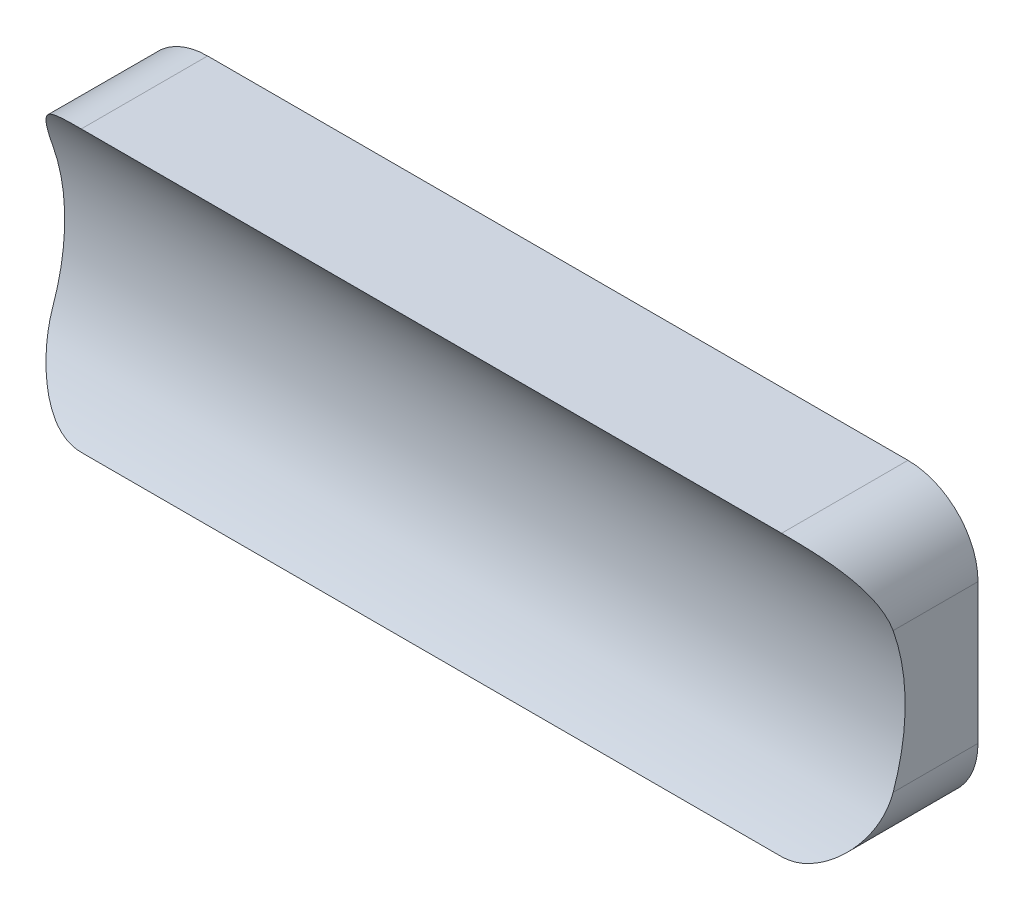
ISO-10303-21;
HEADER;
FILE_DESCRIPTION(('STEP AP214'),'2;1');
FILE_NAME('part.step','',(''),(''),'','','');
FILE_SCHEMA(('AUTOMOTIVE_DESIGN { 1 0 10303 214 1 1 1 1 }'));
ENDSEC;
DATA;
#1=APPLICATION_CONTEXT('core data for automotive mechanical design processes');
#2=APPLICATION_PROTOCOL_DEFINITION('international standard','automotive_design',2000,#1);
#3=PRODUCT_CONTEXT('',#1,'mechanical');
#4=PRODUCT('Part','Part','',(#3));
#5=PRODUCT_RELATED_PRODUCT_CATEGORY('part','',(#4));
#6=PRODUCT_DEFINITION_FORMATION('','',#4);
#7=PRODUCT_DEFINITION_CONTEXT('part definition',#1,'design');
#8=PRODUCT_DEFINITION('design','',#6,#7);
#9=PRODUCT_DEFINITION_SHAPE('','',#8);
#10=(LENGTH_UNIT() NAMED_UNIT(*) SI_UNIT(.MILLI.,.METRE.));
#11=(NAMED_UNIT(*) PLANE_ANGLE_UNIT() SI_UNIT($,.RADIAN.));
#12=(NAMED_UNIT(*) SI_UNIT($,.STERADIAN.) SOLID_ANGLE_UNIT());
#13=UNCERTAINTY_MEASURE_WITH_UNIT(LENGTH_MEASURE(1.E-05),#10,'distance_accuracy_value','');
#14=(GEOMETRIC_REPRESENTATION_CONTEXT(3) GLOBAL_UNCERTAINTY_ASSIGNED_CONTEXT((#13)) GLOBAL_UNIT_ASSIGNED_CONTEXT((#10,
#11,#12)) REPRESENTATION_CONTEXT('',''));
#15=CARTESIAN_POINT('',(0.,0.,0.));
#16=DIRECTION('',(0.,0.,1.));
#17=DIRECTION('',(1.,0.,0.));
#18=AXIS2_PLACEMENT_3D('',#15,#16,#17);
#19=CARTESIAN_POINT('',(19.05,-6.35,8.255));
#20=DIRECTION('',(0.,1.,0.));
#21=DIRECTION('',(0.,0.,1.));
#22=AXIS2_PLACEMENT_3D('',#19,#20,#21);
#23=PLANE('',#22);
#24=DIRECTION('',(-1.,0.,0.));
#25=VECTOR('',#24,1.);
#26=CARTESIAN_POINT('',(45.9907683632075,-6.35,5.72748417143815));
#27=LINE('',#26,#25);
#28=CARTESIAN_POINT('',(15.875,-6.35,5.72748417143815));
#29=VERTEX_POINT('',#28);
#30=CARTESIAN_POINT('',(-15.875,-6.35,5.72748417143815));
#31=VERTEX_POINT('',#30);
#32=EDGE_CURVE('E106',#29,#31,#27,.T.);
#33=ORIENTED_EDGE('',*,*,#32,.T.);
#34=DIRECTION('',(0.,0.,-1.));
#35=VECTOR('',#34,1.);
#36=CARTESIAN_POINT('',(-15.875,-6.35,8.255));
#37=LINE('',#36,#35);
#38=CARTESIAN_POINT('',(-15.875,-6.35,0.));
#39=VERTEX_POINT('',#38);
#40=EDGE_CURVE('E112',#31,#39,#37,.T.);
#41=ORIENTED_EDGE('',*,*,#40,.T.);
#42=DIRECTION('',(-1.,0.,0.));
#43=VECTOR('',#42,1.);
#44=CARTESIAN_POINT('',(19.05,-6.35,0.));
#45=LINE('',#44,#43);
#46=CARTESIAN_POINT('',(15.875,-6.35,0.));
#47=VERTEX_POINT('',#46);
#48=EDGE_CURVE('E109',#47,#39,#45,.T.);
#49=ORIENTED_EDGE('',*,*,#48,.F.);
#50=DIRECTION('',(0.,0.,-1.));
#51=VECTOR('',#50,1.);
#52=CARTESIAN_POINT('',(15.875,-6.35,5.72748417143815));
#53=LINE('',#52,#51);
#54=EDGE_CURVE('E103',#47,#29,#53,.F.);
#55=ORIENTED_EDGE('',*,*,#54,.T.);
#56=EDGE_LOOP('',(#33,#41,#49,#55));
#57=FACE_BOUND('',#56,.T.);
#58=ADVANCED_FACE('F34',(#57),#23,.F.);
#59=CARTESIAN_POINT('',(19.05,6.35,0.));
#60=DIRECTION('',(0.,0.,1.));
#61=DIRECTION('',(0.,-1.,0.));
#62=AXIS2_PLACEMENT_3D('',#59,#60,#61);
#63=PLANE('',#62);
#64=ORIENTED_EDGE('',*,*,#48,.T.);
#65=CARTESIAN_POINT('',(-15.875,-3.175,0.));
#66=DIRECTION('',(0.,0.,1.));
#67=DIRECTION('',(0.,-1.,0.));
#68=AXIS2_PLACEMENT_3D('',#65,#66,#67);
#69=CIRCLE('',#68,3.175);
#70=CARTESIAN_POINT('',(-19.05,-3.175,0.));
#71=VERTEX_POINT('',#70);
#72=EDGE_CURVE('E197',#39,#71,#69,.F.);
#73=ORIENTED_EDGE('',*,*,#72,.T.);
#74=DIRECTION('',(0.,1.,0.));
#75=VECTOR('',#74,1.);
#76=CARTESIAN_POINT('',(-19.05,6.35,0.));
#77=LINE('',#76,#75);
#78=CARTESIAN_POINT('',(-19.05,3.175,0.));
#79=VERTEX_POINT('',#78);
#80=EDGE_CURVE('E120',#71,#79,#77,.T.);
#81=ORIENTED_EDGE('',*,*,#80,.T.);
#82=CARTESIAN_POINT('',(-15.875,3.175,0.));
#83=DIRECTION('',(0.,0.,1.));
#84=DIRECTION('',(0.,-1.,0.));
#85=AXIS2_PLACEMENT_3D('',#82,#83,#84);
#86=CIRCLE('',#85,3.175);
#87=CARTESIAN_POINT('',(-15.875,6.35,0.));
#88=VERTEX_POINT('',#87);
#89=EDGE_CURVE('E201',#79,#88,#86,.F.);
#90=ORIENTED_EDGE('',*,*,#89,.T.);
#91=DIRECTION('',(-1.,0.,0.));
#92=VECTOR('',#91,1.);
#93=CARTESIAN_POINT('',(19.05,6.35,0.));
#94=LINE('',#93,#92);
#95=CARTESIAN_POINT('',(15.875,6.35,0.));
#96=VERTEX_POINT('',#95);
#97=EDGE_CURVE('E209',#96,#88,#94,.T.);
#98=ORIENTED_EDGE('',*,*,#97,.F.);
#99=CARTESIAN_POINT('',(15.875,3.175,0.));
#100=DIRECTION('',(0.,0.,1.));
#101=DIRECTION('',(0.,-1.,0.));
#102=AXIS2_PLACEMENT_3D('',#99,#100,#101);
#103=CIRCLE('',#102,3.175);
#104=CARTESIAN_POINT('',(19.05,3.175,0.));
#105=VERTEX_POINT('',#104);
#106=EDGE_CURVE('E205',#96,#105,#103,.F.);
#107=ORIENTED_EDGE('',*,*,#106,.T.);
#108=DIRECTION('',(0.,1.,0.));
#109=VECTOR('',#108,1.);
#110=CARTESIAN_POINT('',(19.05,6.35,0.));
#111=LINE('',#110,#109);
#112=CARTESIAN_POINT('',(19.05,-3.175,0.));
#113=VERTEX_POINT('',#112);
#114=EDGE_CURVE('E195',#113,#105,#111,.T.);
#115=ORIENTED_EDGE('',*,*,#114,.F.);
#116=CARTESIAN_POINT('',(15.875,-3.175,0.));
#117=DIRECTION('',(0.,0.,1.));
#118=DIRECTION('',(0.,-1.,0.));
#119=AXIS2_PLACEMENT_3D('',#116,#117,#118);
#120=CIRCLE('',#119,3.175);
#121=EDGE_CURVE('E203',#113,#47,#120,.F.);
#122=ORIENTED_EDGE('',*,*,#121,.T.);
#123=EDGE_LOOP('',(#64,#73,#81,#90,#98,#107,#115,#122));
#124=FACE_BOUND('',#123,.T.);
#125=ADVANCED_FACE('F173',(#124),#63,.F.);
#126=CARTESIAN_POINT('',(19.05,6.35,8.255));
#127=DIRECTION('',(0.,-1.,0.));
#128=DIRECTION('',(0.,0.,-1.));
#129=AXIS2_PLACEMENT_3D('',#126,#127,#128);
#130=PLANE('',#129);
#131=ORIENTED_EDGE('',*,*,#97,.T.);
#132=DIRECTION('',(0.,0.,1.));
#133=VECTOR('',#132,1.);
#134=CARTESIAN_POINT('',(-15.875,6.35,8.255));
#135=LINE('',#134,#133);
#136=CARTESIAN_POINT('',(-15.875,6.35,5.72748417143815));
#137=VERTEX_POINT('',#136);
#138=EDGE_CURVE('E218',#88,#137,#135,.T.);
#139=ORIENTED_EDGE('',*,*,#138,.T.);
#140=DIRECTION('',(-1.,0.,0.));
#141=VECTOR('',#140,1.);
#142=CARTESIAN_POINT('',(45.9907683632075,6.35,5.72748417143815));
#143=LINE('',#142,#141);
#144=CARTESIAN_POINT('',(15.875,6.35,5.72748417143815));
#145=VERTEX_POINT('',#144);
#146=EDGE_CURVE('E121',#137,#145,#143,.F.);
#147=ORIENTED_EDGE('',*,*,#146,.T.);
#148=DIRECTION('',(0.,0.,1.));
#149=VECTOR('',#148,1.);
#150=CARTESIAN_POINT('',(15.875,6.35,0.));
#151=LINE('',#150,#149);
#152=EDGE_CURVE('E158',#145,#96,#151,.F.);
#153=ORIENTED_EDGE('',*,*,#152,.T.);
#154=EDGE_LOOP('',(#131,#139,#147,#153));
#155=FACE_BOUND('',#154,.T.);
#156=ADVANCED_FACE('F177',(#155),#130,.F.);
#157=CARTESIAN_POINT('',(19.05,-6.35,8.255));
#158=DIRECTION('',(1.,0.,0.));
#159=DIRECTION('',(0.,0.,-1.));
#160=AXIS2_PLACEMENT_3D('',#157,#158,#159);
#161=PLANE('',#160);
#162=CARTESIAN_POINT('',(19.05,0.,12.827));
#163=DIRECTION('',(1.,0.,0.));
#164=DIRECTION('',(0.,0.,-1.));
#165=AXIS2_PLACEMENT_3D('',#162,#163,#164);
#166=CIRCLE('',#165,9.52500000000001);
#167=CARTESIAN_POINT('',(19.05,3.175,3.84674387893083));
#168=VERTEX_POINT('',#167);
#169=CARTESIAN_POINT('',(19.05,-3.175,3.84674387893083));
#170=VERTEX_POINT('',#169);
#171=EDGE_CURVE('E215',#168,#170,#166,.F.);
#172=ORIENTED_EDGE('',*,*,#171,.T.);
#173=DIRECTION('',(0.,0.,-1.));
#174=VECTOR('',#173,1.);
#175=CARTESIAN_POINT('',(19.05,-3.175,0.));
#176=LINE('',#175,#174);
#177=EDGE_CURVE('E11',#170,#113,#176,.T.);
#178=ORIENTED_EDGE('',*,*,#177,.T.);
#179=ORIENTED_EDGE('',*,*,#114,.T.);
#180=DIRECTION('',(0.,0.,1.));
#181=VECTOR('',#180,1.);
#182=CARTESIAN_POINT('',(19.05,3.175,5.72748417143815));
#183=LINE('',#182,#181);
#184=EDGE_CURVE('E43',#105,#168,#183,.T.);
#185=ORIENTED_EDGE('',*,*,#184,.T.);
#186=EDGE_LOOP('',(#172,#178,#179,#185));
#187=FACE_BOUND('',#186,.T.);
#188=ADVANCED_FACE('F148',(#187),#161,.T.);
#189=CARTESIAN_POINT('',(-19.05,-6.35,8.255));
#190=DIRECTION('',(1.,0.,0.));
#191=DIRECTION('',(0.,0.,-1.));
#192=AXIS2_PLACEMENT_3D('',#189,#190,#191);
#193=PLANE('',#192);
#194=ORIENTED_EDGE('',*,*,#80,.F.);
#195=DIRECTION('',(0.,0.,-1.));
#196=VECTOR('',#195,1.);
#197=CARTESIAN_POINT('',(-19.05,-3.175,8.255));
#198=LINE('',#197,#196);
#199=CARTESIAN_POINT('',(-19.05,-3.175,3.84674387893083));
#200=VERTEX_POINT('',#199);
#201=EDGE_CURVE('E127',#71,#200,#198,.F.);
#202=ORIENTED_EDGE('',*,*,#201,.T.);
#203=CARTESIAN_POINT('',(-19.05,0.,12.827));
#204=DIRECTION('',(-1.,0.,0.));
#205=DIRECTION('',(0.,0.,1.));
#206=AXIS2_PLACEMENT_3D('',#203,#204,#205);
#207=CIRCLE('',#206,9.52500000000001);
#208=CARTESIAN_POINT('',(-19.05,3.175,3.84674387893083));
#209=VERTEX_POINT('',#208);
#210=EDGE_CURVE('E217',#209,#200,#207,.T.);
#211=ORIENTED_EDGE('',*,*,#210,.F.);
#212=DIRECTION('',(0.,0.,1.));
#213=VECTOR('',#212,1.);
#214=CARTESIAN_POINT('',(-19.05,3.175,8.255));
#215=LINE('',#214,#213);
#216=EDGE_CURVE('E194',#209,#79,#215,.F.);
#217=ORIENTED_EDGE('',*,*,#216,.T.);
#218=EDGE_LOOP('',(#194,#202,#211,#217));
#219=FACE_BOUND('',#218,.T.);
#220=ADVANCED_FACE('F147',(#219),#193,.F.);
#221=CARTESIAN_POINT('',(45.9907683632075,0.,12.827));
#222=DIRECTION('',(-1.,0.,0.));
#223=DIRECTION('',(0.,0.,1.));
#224=AXIS2_PLACEMENT_3D('',#221,#222,#223);
#225=CYLINDRICAL_SURFACE('',#224,9.52500000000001);
#226=ORIENTED_EDGE('',*,*,#210,.T.);
#227=CARTESIAN_POINT('',(-19.05,-3.175,3.84674387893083));
#228=CARTESIAN_POINT('',(-19.0500070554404,-3.27165376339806,3.88089987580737));
#229=CARTESIAN_POINT('',(-19.0455873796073,-3.3677140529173,3.91663340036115));
#230=CARTESIAN_POINT('',(-19.028268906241,-3.55790883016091,3.99086700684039));
#231=CARTESIAN_POINT('',(-19.0153761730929,-3.65204464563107,4.02936509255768));
#232=CARTESIAN_POINT('',(-18.9815654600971,-3.83735010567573,4.10860035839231));
#233=CARTESIAN_POINT('',(-18.9606859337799,-3.92853172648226,4.14932602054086));
#234=CARTESIAN_POINT('',(-18.9112905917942,-4.10785595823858,4.23276114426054));
#235=CARTESIAN_POINT('',(-18.8827734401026,-4.19599803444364,4.27547095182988));
#236=CARTESIAN_POINT('',(-18.7865009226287,-4.45466663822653,4.40567986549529));
#237=CARTESIAN_POINT('',(-18.7078988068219,-4.62010190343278,4.49554656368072));
#238=CARTESIAN_POINT('',(-18.5241971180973,-4.93444559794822,4.67776404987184));
#239=CARTESIAN_POINT('',(-18.4190373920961,-5.08331538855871,4.77012004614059));
#240=CARTESIAN_POINT('',(-18.1738048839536,-5.37395079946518,4.96068039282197));
#241=CARTESIAN_POINT('',(-18.0314854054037,-5.51396116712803,5.05869128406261));
#242=CARTESIAN_POINT('',(-17.7192488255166,-5.76722793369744,5.2448275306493));
#243=CARTESIAN_POINT('',(-17.5493776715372,-5.8805281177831,5.33296893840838));
#244=CARTESIAN_POINT('',(-17.2392583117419,-6.04558974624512,5.46601260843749));
#245=CARTESIAN_POINT('',(-17.1055479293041,-6.10560330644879,5.51593547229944));
#246=CARTESIAN_POINT('',(-16.827481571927,-6.20735593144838,5.60212511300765));
#247=CARTESIAN_POINT('',(-16.6831612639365,-6.24915322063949,5.63843534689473));
#248=CARTESIAN_POINT('',(-16.4280310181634,-6.30337970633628,5.68599551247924));
#249=CARTESIAN_POINT('',(-16.3190406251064,-6.32074057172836,5.70140410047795));
#250=CARTESIAN_POINT('',(-16.1537191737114,-6.33823215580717,5.71697227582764));
#251=CARTESIAN_POINT('',(-16.0981609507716,-6.3426379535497,5.72090452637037));
#252=CARTESIAN_POINT('',(-15.986740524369,-6.34852447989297,5.72616420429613));
#253=CARTESIAN_POINT('',(-15.9308781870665,-6.35000379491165,5.72749037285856));
#254=CARTESIAN_POINT('',(-15.875,-6.35,5.72748417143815));
#255=B_SPLINE_CURVE_WITH_KNOTS('',3,(#227,#228,#229,#230,#231,#232,#233,#234,#235,#236,#237,
#238,#239,#240,#241,#242,#243,#244,#245,#246,#247,#248,#249,#250,#251,#252,#253,#254),
.UNSPECIFIED.,.F.,.F.,(4,2,2,2,2,2,2,2,2,2,2,2,2,4),(0.,0.307374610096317,0.614529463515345,
0.920223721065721,1.22597148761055,1.83528262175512,2.44598642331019,3.11001349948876,
3.77294436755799,4.23575166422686,4.69706864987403,5.03031962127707,5.19780780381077,
5.36537686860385),.UNSPECIFIED.);
#256=EDGE_CURVE('E119',#200,#31,#255,.T.);
#257=ORIENTED_EDGE('',*,*,#256,.T.);
#258=ORIENTED_EDGE('',*,*,#32,.F.);
#259=CARTESIAN_POINT('',(15.875,-6.35,5.72748417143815));
#260=CARTESIAN_POINT('',(15.9509153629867,-6.35001882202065,5.72751232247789));
#261=CARTESIAN_POINT('',(16.0268119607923,-6.34727799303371,5.72504973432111));
#262=CARTESIAN_POINT('',(16.1778400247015,-6.33642484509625,5.71535880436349));
#263=CARTESIAN_POINT('',(16.2529721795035,-6.32831789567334,5.70813522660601));
#264=CARTESIAN_POINT('',(16.4011966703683,-6.30698074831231,5.68922672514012));
#265=CARTESIAN_POINT('',(16.4743015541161,-6.29379952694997,5.67758446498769));
#266=CARTESIAN_POINT('',(16.6186709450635,-6.26256211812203,5.6502059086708));
#267=CARTESIAN_POINT('',(16.6899350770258,-6.24450494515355,5.63446878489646));
#268=CARTESIAN_POINT('',(16.8997457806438,-6.18359308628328,5.58188621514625));
#269=CARTESIAN_POINT('',(17.0350111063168,-6.13389336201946,5.5395735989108));
#270=CARTESIAN_POINT('',(17.2946241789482,-6.01851840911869,5.44400077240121));
#271=CARTESIAN_POINT('',(17.41893909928,-5.95279723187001,5.39070914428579));
#272=CARTESIAN_POINT('',(17.7013124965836,-5.77928318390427,5.25455920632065));
#273=CARTESIAN_POINT('',(17.8537733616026,-5.66505690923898,5.16824711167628));
#274=CARTESIAN_POINT('',(18.1340098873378,-5.41396976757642,4.98873162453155));
#275=CARTESIAN_POINT('',(18.2617543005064,-5.27708064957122,4.89551971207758));
#276=CARTESIAN_POINT('',(18.4923999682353,-4.98200410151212,4.70688586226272));
#277=CARTESIAN_POINT('',(18.5950106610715,-4.82359774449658,4.61145088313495));
#278=CARTESIAN_POINT('',(18.7711389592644,-4.48973882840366,4.42435841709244));
#279=CARTESIAN_POINT('',(18.8447124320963,-4.31431982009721,4.33269398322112));
#280=CARTESIAN_POINT('',(18.9502600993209,-3.98038131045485,4.17191533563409));
#281=CARTESIAN_POINT('',(18.9871585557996,-3.82400409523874,4.10160581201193));
#282=CARTESIAN_POINT('',(19.024567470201,-3.58418387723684,4.00164959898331));
#283=CARTESIAN_POINT('',(19.0340480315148,-3.50323581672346,3.96920192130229));
#284=CARTESIAN_POINT('',(19.0467663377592,-3.34000796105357,3.90636972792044));
#285=CARTESIAN_POINT('',(19.05000052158,-3.2577274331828,3.87598639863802));
#286=CARTESIAN_POINT('',(19.05,-3.175,3.84674387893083));
#287=B_SPLINE_CURVE_WITH_KNOTS('',3,(#259,#260,#261,#262,#263,#264,#265,#266,#267,#268,#269,
#270,#271,#272,#273,#274,#275,#276,#277,#278,#279,#280,#281,#282,#283,#284,#285,#286),
.UNSPECIFIED.,.F.,.F.,(4,2,2,2,2,2,2,2,2,2,2,2,2,4),(0.,0.227626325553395,0.455025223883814,
0.680282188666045,0.905584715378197,1.3540736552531,1.8038642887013,2.42799604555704,
3.05291177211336,3.68474291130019,4.31535241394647,4.83956523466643,5.10250499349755,
5.3655946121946),.UNSPECIFIED.);
#288=EDGE_CURVE('E116',#29,#170,#287,.T.);
#289=ORIENTED_EDGE('',*,*,#288,.T.);
#290=ORIENTED_EDGE('',*,*,#171,.F.);
#291=CARTESIAN_POINT('',(19.05,3.175,3.84674387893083));
#292=CARTESIAN_POINT('',(19.0500070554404,3.27165376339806,3.88089987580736));
#293=CARTESIAN_POINT('',(19.0455873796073,3.36771405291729,3.91663340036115));
#294=CARTESIAN_POINT('',(19.028268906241,3.55790883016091,3.99086700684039));
#295=CARTESIAN_POINT('',(19.0153761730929,3.65204464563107,4.02936509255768));
#296=CARTESIAN_POINT('',(18.9815654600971,3.83735010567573,4.10860035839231));
#297=CARTESIAN_POINT('',(18.9606859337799,3.92853172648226,4.14932602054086));
#298=CARTESIAN_POINT('',(18.9112905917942,4.10785595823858,4.23276114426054));
#299=CARTESIAN_POINT('',(18.8827734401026,4.19599803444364,4.27547095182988));
#300=CARTESIAN_POINT('',(18.7865009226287,4.45466663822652,4.40567986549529));
#301=CARTESIAN_POINT('',(18.7078988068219,4.62010190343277,4.49554656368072));
#302=CARTESIAN_POINT('',(18.5241971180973,4.93444559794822,4.67776404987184));
#303=CARTESIAN_POINT('',(18.4190373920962,5.08331538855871,4.77012004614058));
#304=CARTESIAN_POINT('',(18.1738048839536,5.37395079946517,4.96068039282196));
#305=CARTESIAN_POINT('',(18.0314854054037,5.51396116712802,5.05869128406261));
#306=CARTESIAN_POINT('',(17.7192488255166,5.76722793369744,5.2448275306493));
#307=CARTESIAN_POINT('',(17.5493776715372,5.8805281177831,5.33296893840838));
#308=CARTESIAN_POINT('',(17.2392583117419,6.04558974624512,5.46601260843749));
#309=CARTESIAN_POINT('',(17.1055479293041,6.10560330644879,5.51593547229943));
#310=CARTESIAN_POINT('',(16.827481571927,6.20735593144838,5.60212511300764));
#311=CARTESIAN_POINT('',(16.6831612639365,6.24915322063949,5.63843534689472));
#312=CARTESIAN_POINT('',(16.4280310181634,6.30337970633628,5.68599551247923));
#313=CARTESIAN_POINT('',(16.3190406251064,6.32074057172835,5.70140410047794));
#314=CARTESIAN_POINT('',(16.1537191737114,6.33823215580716,5.71697227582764));
#315=CARTESIAN_POINT('',(16.0981609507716,6.3426379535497,5.72090452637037));
#316=CARTESIAN_POINT('',(15.986740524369,6.34852447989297,5.72616420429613));
#317=CARTESIAN_POINT('',(15.9308781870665,6.35000379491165,5.72749037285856));
#318=CARTESIAN_POINT('',(15.875,6.35,5.72748417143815));
#319=B_SPLINE_CURVE_WITH_KNOTS('',3,(#291,#292,#293,#294,#295,#296,#297,#298,#299,#300,#301,
#302,#303,#304,#305,#306,#307,#308,#309,#310,#311,#312,#313,#314,#315,#316,#317,#318),
.UNSPECIFIED.,.F.,.F.,(4,2,2,2,2,2,2,2,2,2,2,2,2,4),(0.,0.307374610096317,0.614529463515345,
0.920223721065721,1.22597148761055,1.83528262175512,2.44598642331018,3.11001349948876,
3.77294436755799,4.23575166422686,4.69706864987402,5.03031962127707,5.19780780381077,
5.36537686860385),.UNSPECIFIED.);
#320=EDGE_CURVE('E50',#168,#145,#319,.T.);
#321=ORIENTED_EDGE('',*,*,#320,.T.);
#322=ORIENTED_EDGE('',*,*,#146,.F.);
#323=CARTESIAN_POINT('',(-15.875,6.35,5.72748417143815));
#324=CARTESIAN_POINT('',(-15.9509153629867,6.35001882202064,5.72751232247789));
#325=CARTESIAN_POINT('',(-16.0268119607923,6.34727799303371,5.72504973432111));
#326=CARTESIAN_POINT('',(-16.1778400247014,6.33642484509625,5.71535880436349));
#327=CARTESIAN_POINT('',(-16.2529721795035,6.32831789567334,5.70813522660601));
#328=CARTESIAN_POINT('',(-16.4011966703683,6.30698074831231,5.68922672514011));
#329=CARTESIAN_POINT('',(-16.4743015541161,6.29379952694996,5.67758446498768));
#330=CARTESIAN_POINT('',(-16.6186709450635,6.26256211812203,5.6502059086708));
#331=CARTESIAN_POINT('',(-16.6899350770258,6.24450494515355,5.63446878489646));
#332=CARTESIAN_POINT('',(-16.8997457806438,6.18359308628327,5.58188621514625));
#333=CARTESIAN_POINT('',(-17.0350111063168,6.13389336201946,5.5395735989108));
#334=CARTESIAN_POINT('',(-17.2946241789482,6.01851840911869,5.44400077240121));
#335=CARTESIAN_POINT('',(-17.41893909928,5.95279723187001,5.39070914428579));
#336=CARTESIAN_POINT('',(-17.7013124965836,5.77928318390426,5.25455920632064));
#337=CARTESIAN_POINT('',(-17.8537733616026,5.66505690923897,5.16824711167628));
#338=CARTESIAN_POINT('',(-18.1340098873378,5.41396976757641,4.98873162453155));
#339=CARTESIAN_POINT('',(-18.2617543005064,5.27708064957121,4.89551971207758));
#340=CARTESIAN_POINT('',(-18.4923999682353,4.98200410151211,4.70688586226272));
#341=CARTESIAN_POINT('',(-18.5950106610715,4.82359774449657,4.61145088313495));
#342=CARTESIAN_POINT('',(-18.7711389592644,4.48973882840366,4.42435841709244));
#343=CARTESIAN_POINT('',(-18.8447124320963,4.31431982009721,4.33269398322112));
#344=CARTESIAN_POINT('',(-18.9502600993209,3.98038131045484,4.17191533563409));
#345=CARTESIAN_POINT('',(-18.9871585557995,3.82400409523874,4.10160581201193));
#346=CARTESIAN_POINT('',(-19.024567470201,3.58418387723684,4.00164959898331));
#347=CARTESIAN_POINT('',(-19.0340480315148,3.50323581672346,3.96920192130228));
#348=CARTESIAN_POINT('',(-19.0467663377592,3.34000796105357,3.90636972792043));
#349=CARTESIAN_POINT('',(-19.05000052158,3.25772743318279,3.87598639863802));
#350=CARTESIAN_POINT('',(-19.05,3.175,3.84674387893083));
#351=B_SPLINE_CURVE_WITH_KNOTS('',3,(#323,#324,#325,#326,#327,#328,#329,#330,#331,#332,#333,
#334,#335,#336,#337,#338,#339,#340,#341,#342,#343,#344,#345,#346,#347,#348,#349,#350),
.UNSPECIFIED.,.F.,.F.,(4,2,2,2,2,2,2,2,2,2,2,2,2,4),(0.,0.227626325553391,0.455025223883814,
0.680282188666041,0.905584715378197,1.3540736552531,1.8038642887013,2.42799604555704,
3.05291177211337,3.68474291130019,4.31535241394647,4.83956523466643,5.10250499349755,
5.3655946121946),.UNSPECIFIED.);
#352=EDGE_CURVE('E58',#137,#209,#351,.T.);
#353=ORIENTED_EDGE('',*,*,#352,.T.);
#354=EDGE_LOOP('',(#226,#257,#258,#289,#290,#321,#322,#353));
#355=FACE_BOUND('',#354,.T.);
#356=ADVANCED_FACE('F115',(#355),#225,.F.);
#357=CARTESIAN_POINT('',(-15.875,-3.175,8.255));
#358=DIRECTION('',(0.,0.,-1.));
#359=DIRECTION('',(0.,1.,0.));
#360=AXIS2_PLACEMENT_3D('',#357,#358,#359);
#361=CYLINDRICAL_SURFACE('',#360,3.175);
#362=ORIENTED_EDGE('',*,*,#256,.F.);
#363=ORIENTED_EDGE('',*,*,#201,.F.);
#364=ORIENTED_EDGE('',*,*,#72,.F.);
#365=ORIENTED_EDGE('',*,*,#40,.F.);
#366=EDGE_LOOP('',(#362,#363,#364,#365));
#367=FACE_BOUND('',#366,.T.);
#368=ADVANCED_FACE('F146',(#367),#361,.T.);
#369=CARTESIAN_POINT('',(-15.875,3.175,8.255));
#370=DIRECTION('',(0.,0.,1.));
#371=DIRECTION('',(0.,-1.,0.));
#372=AXIS2_PLACEMENT_3D('',#369,#370,#371);
#373=CYLINDRICAL_SURFACE('',#372,3.175);
#374=ORIENTED_EDGE('',*,*,#89,.F.);
#375=ORIENTED_EDGE('',*,*,#216,.F.);
#376=ORIENTED_EDGE('',*,*,#352,.F.);
#377=ORIENTED_EDGE('',*,*,#138,.F.);
#378=EDGE_LOOP('',(#374,#375,#376,#377));
#379=FACE_BOUND('',#378,.T.);
#380=ADVANCED_FACE('F163',(#379),#373,.T.);
#381=CARTESIAN_POINT('',(15.875,-3.175,8.255));
#382=DIRECTION('',(0.,0.,1.));
#383=DIRECTION('',(0.,-1.,0.));
#384=AXIS2_PLACEMENT_3D('',#381,#382,#383);
#385=CYLINDRICAL_SURFACE('',#384,3.175);
#386=ORIENTED_EDGE('',*,*,#288,.F.);
#387=ORIENTED_EDGE('',*,*,#54,.F.);
#388=ORIENTED_EDGE('',*,*,#121,.F.);
#389=ORIENTED_EDGE('',*,*,#177,.F.);
#390=EDGE_LOOP('',(#386,#387,#388,#389));
#391=FACE_BOUND('',#390,.T.);
#392=ADVANCED_FACE('F124',(#391),#385,.T.);
#393=CARTESIAN_POINT('',(15.875,3.175,8.255));
#394=DIRECTION('',(0.,0.,-1.));
#395=DIRECTION('',(0.,1.,0.));
#396=AXIS2_PLACEMENT_3D('',#393,#394,#395);
#397=CYLINDRICAL_SURFACE('',#396,3.175);
#398=ORIENTED_EDGE('',*,*,#106,.F.);
#399=ORIENTED_EDGE('',*,*,#152,.F.);
#400=ORIENTED_EDGE('',*,*,#320,.F.);
#401=ORIENTED_EDGE('',*,*,#184,.F.);
#402=EDGE_LOOP('',(#398,#399,#400,#401));
#403=FACE_BOUND('',#402,.T.);
#404=ADVANCED_FACE('F36',(#403),#397,.T.);
#405=CLOSED_SHELL('',(#58,#125,#156,#188,#220,#356,#368,#380,#392,#404));
#406=MANIFOLD_SOLID_BREP('B2',#405);
#407=ADVANCED_BREP_SHAPE_REPRESENTATION('',(#18,#406),#14);
#408=SHAPE_DEFINITION_REPRESENTATION(#9,#407);
ENDSEC;
END-ISO-10303-21;
